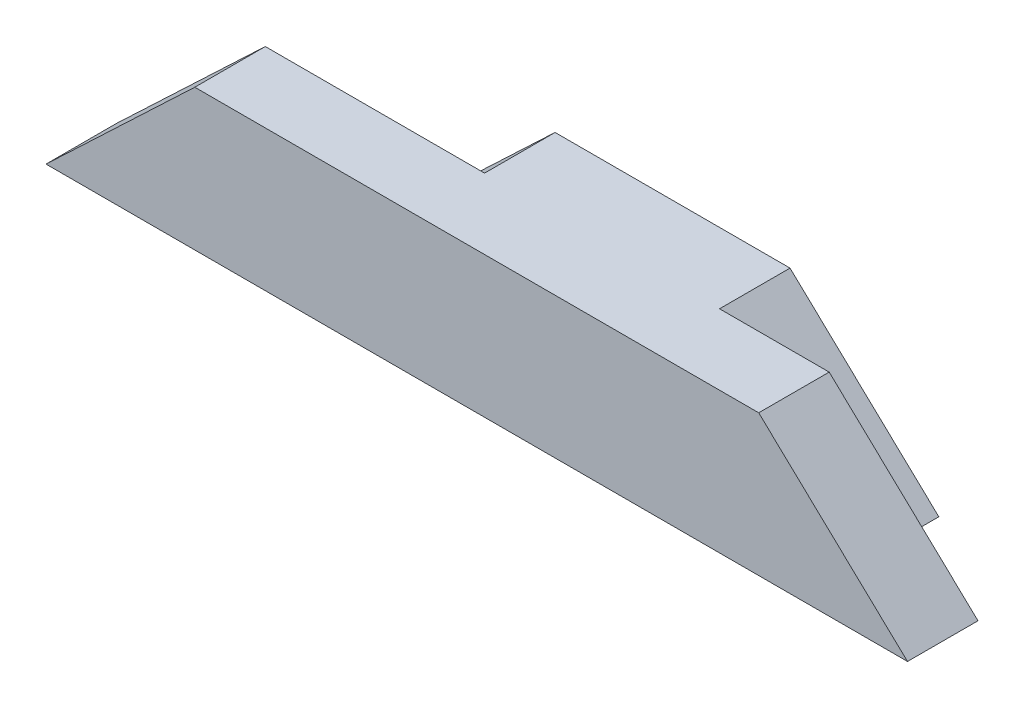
ISO-10303-21;
HEADER;
FILE_DESCRIPTION(('STEP AP214'),'2;1');
FILE_NAME('part.step','',(''),(''),'','','');
FILE_SCHEMA(('AUTOMOTIVE_DESIGN { 1 0 10303 214 1 1 1 1 }'));
ENDSEC;
DATA;
#1=APPLICATION_CONTEXT('core data for automotive mechanical design processes');
#2=APPLICATION_PROTOCOL_DEFINITION('international standard','automotive_design',2000,#1);
#3=PRODUCT_CONTEXT('',#1,'mechanical');
#4=PRODUCT('Part','Part','',(#3));
#5=PRODUCT_RELATED_PRODUCT_CATEGORY('part','',(#4));
#6=PRODUCT_DEFINITION_FORMATION('','',#4);
#7=PRODUCT_DEFINITION_CONTEXT('part definition',#1,'design');
#8=PRODUCT_DEFINITION('design','',#6,#7);
#9=PRODUCT_DEFINITION_SHAPE('','',#8);
#10=(LENGTH_UNIT() NAMED_UNIT(*) SI_UNIT(.MILLI.,.METRE.));
#11=(NAMED_UNIT(*) PLANE_ANGLE_UNIT() SI_UNIT($,.RADIAN.));
#12=(NAMED_UNIT(*) SI_UNIT($,.STERADIAN.) SOLID_ANGLE_UNIT());
#13=UNCERTAINTY_MEASURE_WITH_UNIT(LENGTH_MEASURE(1.E-05),#10,'distance_accuracy_value','');
#14=(GEOMETRIC_REPRESENTATION_CONTEXT(3) GLOBAL_UNCERTAINTY_ASSIGNED_CONTEXT((#13)) GLOBAL_UNIT_ASSIGNED_CONTEXT((#10,
#11,#12)) REPRESENTATION_CONTEXT('',''));
#15=CARTESIAN_POINT('',(0.,0.,0.));
#16=DIRECTION('',(0.,0.,1.));
#17=DIRECTION('',(1.,0.,0.));
#18=AXIS2_PLACEMENT_3D('',#15,#16,#17);
#19=CARTESIAN_POINT('',(9.5,9.,0.));
#20=DIRECTION('',(0.687744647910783,-0.725952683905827,0.));
#21=DIRECTION('',(0.725952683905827,0.687744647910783,0.));
#22=AXIS2_PLACEMENT_3D('',#19,#20,#21);
#23=PLANE('',#22);
#24=DIRECTION('',(0.725952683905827,0.687744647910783,0.));
#25=VECTOR('',#24,1.);
#26=CARTESIAN_POINT('',(0.,0.,4.5));
#27=LINE('',#26,#25);
#28=CARTESIAN_POINT('',(0.,0.,4.5));
#29=VERTEX_POINT('',#28);
#30=CARTESIAN_POINT('',(9.5,9.,4.5));
#31=VERTEX_POINT('',#30);
#32=EDGE_CURVE('E128',#29,#31,#27,.T.);
#33=ORIENTED_EDGE('',*,*,#32,.F.);
#34=DIRECTION('',(0.,0.,-1.));
#35=VECTOR('',#34,1.);
#36=CARTESIAN_POINT('',(0.,0.,9.));
#37=LINE('',#36,#35);
#38=CARTESIAN_POINT('',(0.,0.,9.));
#39=VERTEX_POINT('',#38);
#40=EDGE_CURVE('E11',#39,#29,#37,.T.);
#41=ORIENTED_EDGE('',*,*,#40,.F.);
#42=DIRECTION('',(0.725952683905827,0.687744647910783,0.));
#43=VECTOR('',#42,1.);
#44=CARTESIAN_POINT('',(9.5,9.,9.));
#45=LINE('',#44,#43);
#46=CARTESIAN_POINT('',(9.5,9.,9.));
#47=VERTEX_POINT('',#46);
#48=EDGE_CURVE('E141',#39,#47,#45,.T.);
#49=ORIENTED_EDGE('',*,*,#48,.T.);
#50=DIRECTION('',(0.,0.,1.));
#51=VECTOR('',#50,1.);
#52=CARTESIAN_POINT('',(9.5,9.,0.));
#53=LINE('',#52,#51);
#54=EDGE_CURVE('E146',#31,#47,#53,.T.);
#55=ORIENTED_EDGE('',*,*,#54,.F.);
#56=EDGE_LOOP('',(#33,#41,#49,#55));
#57=FACE_BOUND('',#56,.T.);
#58=ADVANCED_FACE('F31',(#57),#23,.F.);
#59=CARTESIAN_POINT('',(0.,0.,9.));
#60=DIRECTION('',(0.,1.,0.));
#61=DIRECTION('',(0.,0.,1.));
#62=AXIS2_PLACEMENT_3D('',#59,#60,#61);
#63=PLANE('',#62);
#64=DIRECTION('',(-1.,0.,0.));
#65=VECTOR('',#64,1.);
#66=CARTESIAN_POINT('',(48.,0.,4.5));
#67=LINE('',#66,#65);
#68=CARTESIAN_POINT('',(55.,0.,4.5));
#69=VERTEX_POINT('',#68);
#70=CARTESIAN_POINT('',(48.,0.,4.5));
#71=VERTEX_POINT('',#70);
#72=EDGE_CURVE('E120',#69,#71,#67,.T.);
#73=ORIENTED_EDGE('',*,*,#72,.F.);
#74=DIRECTION('',(0.,0.,-1.));
#75=VECTOR('',#74,1.);
#76=CARTESIAN_POINT('',(55.,0.,14.5));
#77=LINE('',#76,#75);
#78=CARTESIAN_POINT('',(55.,0.,9.));
#79=VERTEX_POINT('',#78);
#80=EDGE_CURVE('E46',#79,#69,#77,.T.);
#81=ORIENTED_EDGE('',*,*,#80,.F.);
#82=DIRECTION('',(1.,0.,0.));
#83=VECTOR('',#82,1.);
#84=CARTESIAN_POINT('',(0.,0.,9.));
#85=LINE('',#84,#83);
#86=EDGE_CURVE('E149',#39,#79,#85,.T.);
#87=ORIENTED_EDGE('',*,*,#86,.F.);
#88=ORIENTED_EDGE('',*,*,#40,.T.);
#89=DIRECTION('',(-1.,0.,0.));
#90=VECTOR('',#89,1.);
#91=CARTESIAN_POINT('',(14.,0.,4.5));
#92=LINE('',#91,#90);
#93=CARTESIAN_POINT('',(14.,0.,4.5));
#94=VERTEX_POINT('',#93);
#95=EDGE_CURVE('E54',#94,#29,#92,.T.);
#96=ORIENTED_EDGE('',*,*,#95,.F.);
#97=DIRECTION('',(0.,0.,-1.));
#98=VECTOR('',#97,1.);
#99=CARTESIAN_POINT('',(14.,0.,4.5));
#100=LINE('',#99,#98);
#101=CARTESIAN_POINT('',(14.,0.,0.));
#102=VERTEX_POINT('',#101);
#103=EDGE_CURVE('E138',#94,#102,#100,.T.);
#104=ORIENTED_EDGE('',*,*,#103,.T.);
#105=DIRECTION('',(1.,0.,0.));
#106=VECTOR('',#105,1.);
#107=CARTESIAN_POINT('',(0.,0.,0.));
#108=LINE('',#107,#106);
#109=CARTESIAN_POINT('',(48.,0.,0.));
#110=VERTEX_POINT('',#109);
#111=EDGE_CURVE('E148',#102,#110,#108,.T.);
#112=ORIENTED_EDGE('',*,*,#111,.T.);
#113=DIRECTION('',(0.,0.,-1.));
#114=VECTOR('',#113,1.);
#115=CARTESIAN_POINT('',(48.,0.,4.5));
#116=LINE('',#115,#114);
#117=EDGE_CURVE('E116',#71,#110,#116,.T.);
#118=ORIENTED_EDGE('',*,*,#117,.F.);
#119=EDGE_LOOP('',(#73,#81,#87,#88,#96,#104,#112,#118));
#120=FACE_BOUND('',#119,.T.);
#121=ADVANCED_FACE('F33',(#120),#63,.F.);
#122=CARTESIAN_POINT('',(0.,9.,9.));
#123=DIRECTION('',(0.,-1.,0.));
#124=DIRECTION('',(0.,0.,-1.));
#125=AXIS2_PLACEMENT_3D('',#122,#123,#124);
#126=PLANE('',#125);
#127=DIRECTION('',(-1.,0.,0.));
#128=VECTOR('',#127,1.);
#129=CARTESIAN_POINT('',(0.,9.,9.));
#130=LINE('',#129,#128);
#131=CARTESIAN_POINT('',(45.5,9.,9.));
#132=VERTEX_POINT('',#131);
#133=EDGE_CURVE('E39',#132,#47,#130,.T.);
#134=ORIENTED_EDGE('',*,*,#133,.F.);
#135=DIRECTION('',(0.,0.,-1.));
#136=VECTOR('',#135,1.);
#137=CARTESIAN_POINT('',(45.5,9.,14.5));
#138=LINE('',#137,#136);
#139=CARTESIAN_POINT('',(45.5,9.,4.5));
#140=VERTEX_POINT('',#139);
#141=EDGE_CURVE('E97',#132,#140,#138,.T.);
#142=ORIENTED_EDGE('',*,*,#141,.T.);
#143=DIRECTION('',(1.,0.,0.));
#144=VECTOR('',#143,1.);
#145=CARTESIAN_POINT('',(52.5,9.,4.5));
#146=LINE('',#145,#144);
#147=CARTESIAN_POINT('',(38.5,9.,4.5));
#148=VERTEX_POINT('',#147);
#149=EDGE_CURVE('E108',#148,#140,#146,.T.);
#150=ORIENTED_EDGE('',*,*,#149,.F.);
#151=DIRECTION('',(0.,0.,-1.));
#152=VECTOR('',#151,1.);
#153=CARTESIAN_POINT('',(38.5,9.,4.5));
#154=LINE('',#153,#152);
#155=CARTESIAN_POINT('',(38.5,9.,0.));
#156=VERTEX_POINT('',#155);
#157=EDGE_CURVE('E118',#148,#156,#154,.T.);
#158=ORIENTED_EDGE('',*,*,#157,.T.);
#159=DIRECTION('',(-1.,0.,0.));
#160=VECTOR('',#159,1.);
#161=CARTESIAN_POINT('',(0.,9.,0.));
#162=LINE('',#161,#160);
#163=CARTESIAN_POINT('',(23.5,9.,0.));
#164=VERTEX_POINT('',#163);
#165=EDGE_CURVE('E152',#156,#164,#162,.T.);
#166=ORIENTED_EDGE('',*,*,#165,.T.);
#167=DIRECTION('',(0.,0.,-1.));
#168=VECTOR('',#167,1.);
#169=CARTESIAN_POINT('',(23.5,9.,4.5));
#170=LINE('',#169,#168);
#171=CARTESIAN_POINT('',(23.5,9.,4.5));
#172=VERTEX_POINT('',#171);
#173=EDGE_CURVE('E136',#172,#164,#170,.T.);
#174=ORIENTED_EDGE('',*,*,#173,.F.);
#175=DIRECTION('',(1.,0.,0.));
#176=VECTOR('',#175,1.);
#177=CARTESIAN_POINT('',(9.5,9.,4.5));
#178=LINE('',#177,#176);
#179=EDGE_CURVE('E130',#31,#172,#178,.T.);
#180=ORIENTED_EDGE('',*,*,#179,.F.);
#181=ORIENTED_EDGE('',*,*,#54,.T.);
#182=EDGE_LOOP('',(#134,#142,#150,#158,#166,#174,#180,#181));
#183=FACE_BOUND('',#182,.T.);
#184=ADVANCED_FACE('F106',(#183),#126,.F.);
#185=CARTESIAN_POINT('',(0.,9.,9.));
#186=DIRECTION('',(0.,0.,-1.));
#187=DIRECTION('',(-1.,0.,0.));
#188=AXIS2_PLACEMENT_3D('',#185,#186,#187);
#189=PLANE('',#188);
#190=ORIENTED_EDGE('',*,*,#86,.T.);
#191=DIRECTION('',(-0.725952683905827,0.687744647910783,0.));
#192=VECTOR('',#191,1.);
#193=CARTESIAN_POINT('',(21.5211678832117,31.7167883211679,9.));
#194=LINE('',#193,#192);
#195=EDGE_CURVE('E110',#79,#132,#194,.T.);
#196=ORIENTED_EDGE('',*,*,#195,.T.);
#197=ORIENTED_EDGE('',*,*,#133,.T.);
#198=ORIENTED_EDGE('',*,*,#48,.F.);
#199=EDGE_LOOP('',(#190,#196,#197,#198));
#200=FACE_BOUND('',#199,.T.);
#201=ADVANCED_FACE('F173',(#200),#189,.F.);
#202=CARTESIAN_POINT('',(0.,9.,0.));
#203=DIRECTION('',(0.,0.,-1.));
#204=DIRECTION('',(-1.,0.,0.));
#205=AXIS2_PLACEMENT_3D('',#202,#203,#204);
#206=PLANE('',#205);
#207=DIRECTION('',(-0.725952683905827,0.687744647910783,0.));
#208=VECTOR('',#207,1.);
#209=CARTESIAN_POINT('',(38.5,9.,0.));
#210=LINE('',#209,#208);
#211=EDGE_CURVE('E124',#110,#156,#210,.T.);
#212=ORIENTED_EDGE('',*,*,#211,.F.);
#213=ORIENTED_EDGE('',*,*,#111,.F.);
#214=DIRECTION('',(-0.725952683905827,-0.687744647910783,0.));
#215=VECTOR('',#214,1.);
#216=CARTESIAN_POINT('',(23.5,9.,0.));
#217=LINE('',#216,#215);
#218=EDGE_CURVE('E126',#164,#102,#217,.T.);
#219=ORIENTED_EDGE('',*,*,#218,.F.);
#220=ORIENTED_EDGE('',*,*,#165,.F.);
#221=EDGE_LOOP('',(#212,#213,#219,#220));
#222=FACE_BOUND('',#221,.T.);
#223=ADVANCED_FACE('F164',(#222),#206,.T.);
#224=CARTESIAN_POINT('',(23.5,9.,4.5));
#225=DIRECTION('',(0.687744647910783,-0.725952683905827,0.));
#226=DIRECTION('',(0.725952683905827,0.687744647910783,0.));
#227=AXIS2_PLACEMENT_3D('',#224,#225,#226);
#228=PLANE('',#227);
#229=ORIENTED_EDGE('',*,*,#218,.T.);
#230=ORIENTED_EDGE('',*,*,#103,.F.);
#231=DIRECTION('',(-0.725952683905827,-0.687744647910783,0.));
#232=VECTOR('',#231,1.);
#233=CARTESIAN_POINT('',(23.5,9.,4.5));
#234=LINE('',#233,#232);
#235=EDGE_CURVE('E133',#172,#94,#234,.T.);
#236=ORIENTED_EDGE('',*,*,#235,.F.);
#237=ORIENTED_EDGE('',*,*,#173,.T.);
#238=EDGE_LOOP('',(#229,#230,#236,#237));
#239=FACE_BOUND('',#238,.T.);
#240=ADVANCED_FACE('F162',(#239),#228,.F.);
#241=CARTESIAN_POINT('',(9.50000000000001,9.,4.5));
#242=DIRECTION('',(0.,0.,-1.));
#243=DIRECTION('',(-1.,0.,0.));
#244=AXIS2_PLACEMENT_3D('',#241,#242,#243);
#245=PLANE('',#244);
#246=ORIENTED_EDGE('',*,*,#32,.T.);
#247=ORIENTED_EDGE('',*,*,#179,.T.);
#248=ORIENTED_EDGE('',*,*,#235,.T.);
#249=ORIENTED_EDGE('',*,*,#95,.T.);
#250=EDGE_LOOP('',(#246,#247,#248,#249));
#251=FACE_BOUND('',#250,.T.);
#252=ADVANCED_FACE('F167',(#251),#245,.T.);
#253=CARTESIAN_POINT('',(38.5,9.,4.5));
#254=DIRECTION('',(-0.687744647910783,-0.725952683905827,0.));
#255=DIRECTION('',(0.725952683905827,-0.687744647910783,0.));
#256=AXIS2_PLACEMENT_3D('',#253,#254,#255);
#257=PLANE('',#256);
#258=ORIENTED_EDGE('',*,*,#211,.T.);
#259=ORIENTED_EDGE('',*,*,#157,.F.);
#260=DIRECTION('',(-0.725952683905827,0.687744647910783,0.));
#261=VECTOR('',#260,1.);
#262=CARTESIAN_POINT('',(38.5,9.,4.5));
#263=LINE('',#262,#261);
#264=EDGE_CURVE('E115',#71,#148,#263,.T.);
#265=ORIENTED_EDGE('',*,*,#264,.F.);
#266=ORIENTED_EDGE('',*,*,#117,.T.);
#267=EDGE_LOOP('',(#258,#259,#265,#266));
#268=FACE_BOUND('',#267,.T.);
#269=ADVANCED_FACE('F177',(#268),#257,.F.);
#270=CARTESIAN_POINT('',(52.5,9.,4.5));
#271=DIRECTION('',(0.,0.,1.));
#272=DIRECTION('',(1.,0.,0.));
#273=AXIS2_PLACEMENT_3D('',#270,#271,#272);
#274=PLANE('',#273);
#275=ORIENTED_EDGE('',*,*,#149,.T.);
#276=DIRECTION('',(-0.725952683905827,0.687744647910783,0.));
#277=VECTOR('',#276,1.);
#278=CARTESIAN_POINT('',(55.,0.,4.5));
#279=LINE('',#278,#277);
#280=EDGE_CURVE('E94',#69,#140,#279,.T.);
#281=ORIENTED_EDGE('',*,*,#280,.F.);
#282=ORIENTED_EDGE('',*,*,#72,.T.);
#283=ORIENTED_EDGE('',*,*,#264,.T.);
#284=EDGE_LOOP('',(#275,#281,#282,#283));
#285=FACE_BOUND('',#284,.T.);
#286=ADVANCED_FACE('F113',(#285),#274,.F.);
#287=CARTESIAN_POINT('',(55.,0.,14.5));
#288=DIRECTION('',(-0.687744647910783,-0.725952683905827,0.));
#289=DIRECTION('',(0.725952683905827,-0.687744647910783,0.));
#290=AXIS2_PLACEMENT_3D('',#287,#288,#289);
#291=PLANE('',#290);
#292=ORIENTED_EDGE('',*,*,#80,.T.);
#293=ORIENTED_EDGE('',*,*,#280,.T.);
#294=ORIENTED_EDGE('',*,*,#141,.F.);
#295=ORIENTED_EDGE('',*,*,#195,.F.);
#296=EDGE_LOOP('',(#292,#293,#294,#295));
#297=FACE_BOUND('',#296,.T.);
#298=ADVANCED_FACE('F96',(#297),#291,.F.);
#299=CLOSED_SHELL('',(#58,#121,#184,#201,#223,#240,#252,#269,#286,#298));
#300=MANIFOLD_SOLID_BREP('B2',#299);
#301=ADVANCED_BREP_SHAPE_REPRESENTATION('',(#18,#300),#14);
#302=SHAPE_DEFINITION_REPRESENTATION(#9,#301);
ENDSEC;
END-ISO-10303-21;
